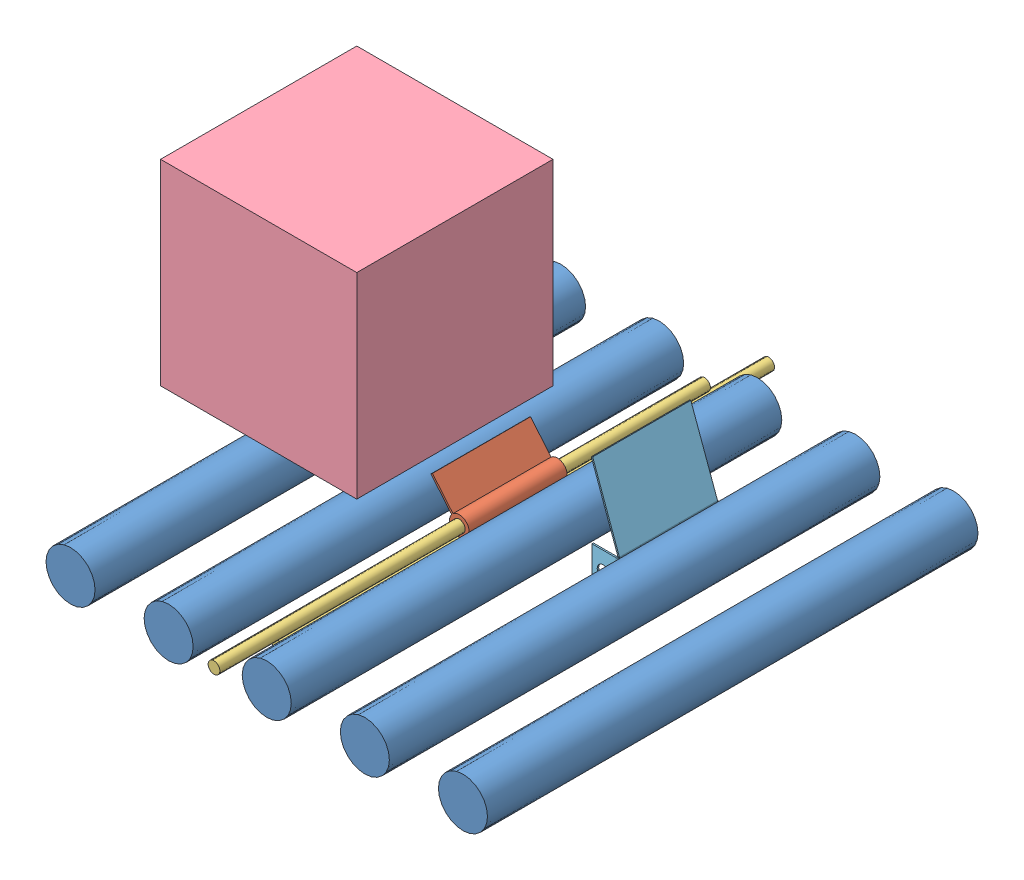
SolidWorks assembly 装配体1.SLDASM, configuration 默认 (file format 9000). Lengths in mm.
Overall size (518.17 288.71 573.62).
10 component instances, 5 part files, 2 mates.
Components (placement in the parent):
- 轴-1: 轴.SLDPRT [默认] at (20.7954 42.1449 -250) size (50 50 500)
- 轴-3: 轴.SLDPRT [默认] at (120.7954 42.1449 -250) size (50 50 500)
- 轴-4: 轴.SLDPRT [默认] at (220.7954 42.1449 -250) size (50 50 500)
- 轴-5: 轴.SLDPRT [默认] at (320.7954 42.1449 -250) size (50 50 500)
- 轴-6: 轴.SLDPRT [默认] at (420.7954 42.1449 -250) size (50 50 500)
- 挡片-1: 挡片.SLDPRT [默认] at (169.7997 38.3388 -45.9621) x (0.965298 0.26115 0) z (0 0 1) size (29.68 82.98 100)
- 轴1-1: 轴1.SLDPRT [默认] at (171.0938 38.3388 -245.9621) size (12 12 500)
- 轴1-2: 轴1.SLDPRT [默认] at (162.8209 15.4263 -319.5854) size (12 12 500)
- 箱子-1: 箱子.SLDPRT [默认] at (-73.6649 70.7759 -134.9471) size (200 200 200)
- 零件5-1: 零件5.SLDPRT [默认] at (283.1447 42.0674 -145.9621) size (28.77 135.18 103)
Mates (geometry in assembly coordinates):
- 同心1: concentric: cylinder of 挡片-1 through (169.7997 38.3388 4.0379) axis (0 0 -1) radius 10; cylinder of 轴1-1 through (169.7997 38.3388 254.0379) axis (0 0 -1) radius 6
- 距离1: distance = 250 mm aligned: plane of 挡片-1 through (169.7997 38.3388 4.0379) normal (0 0 1); plane of 轴1-1 through (169.7997 38.3388 254.0379) normal (0 0 1)
